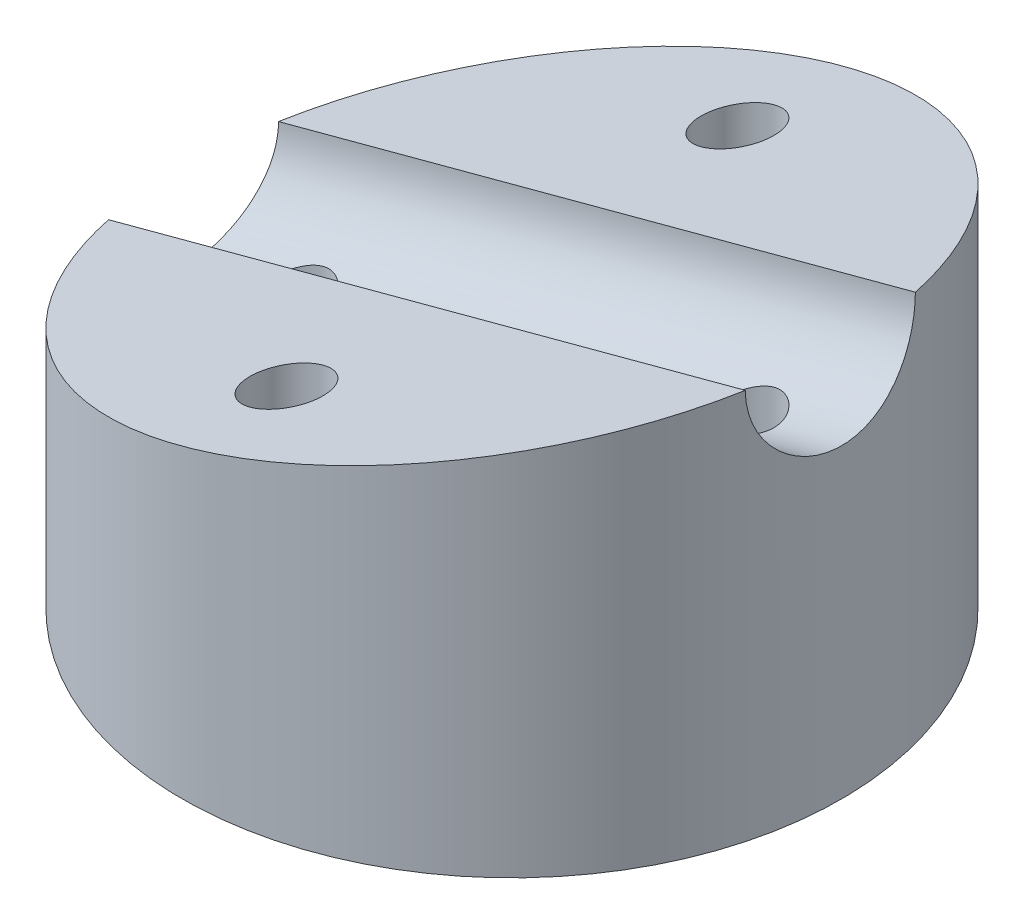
ISO-10303-21;
HEADER;
FILE_DESCRIPTION(('STEP AP214'),'2;1');
FILE_NAME('part.step','',(''),(''),'','','');
FILE_SCHEMA(('AUTOMOTIVE_DESIGN { 1 0 10303 214 1 1 1 1 }'));
ENDSEC;
DATA;
#1=APPLICATION_CONTEXT('core data for automotive mechanical design processes');
#2=APPLICATION_PROTOCOL_DEFINITION('international standard','automotive_design',2000,#1);
#3=PRODUCT_CONTEXT('',#1,'mechanical');
#4=PRODUCT('Part','Part','',(#3));
#5=PRODUCT_RELATED_PRODUCT_CATEGORY('part','',(#4));
#6=PRODUCT_DEFINITION_FORMATION('','',#4);
#7=PRODUCT_DEFINITION_CONTEXT('part definition',#1,'design');
#8=PRODUCT_DEFINITION('design','',#6,#7);
#9=PRODUCT_DEFINITION_SHAPE('','',#8);
#10=(LENGTH_UNIT() NAMED_UNIT(*) SI_UNIT(.MILLI.,.METRE.));
#11=(NAMED_UNIT(*) PLANE_ANGLE_UNIT() SI_UNIT($,.RADIAN.));
#12=(NAMED_UNIT(*) SI_UNIT($,.STERADIAN.) SOLID_ANGLE_UNIT());
#13=UNCERTAINTY_MEASURE_WITH_UNIT(LENGTH_MEASURE(1.E-05),#10,'distance_accuracy_value','');
#14=(GEOMETRIC_REPRESENTATION_CONTEXT(3) GLOBAL_UNCERTAINTY_ASSIGNED_CONTEXT((#13)) GLOBAL_UNIT_ASSIGNED_CONTEXT((#10,
#11,#12)) REPRESENTATION_CONTEXT('',''));
#15=CARTESIAN_POINT('',(0.,0.,0.));
#16=DIRECTION('',(0.,0.,1.));
#17=DIRECTION('',(1.,0.,0.));
#18=AXIS2_PLACEMENT_3D('',#15,#16,#17);
#19=CARTESIAN_POINT('',(0.,0.5,0.));
#20=DIRECTION('',(0.,-1.,0.));
#21=DIRECTION('',(0.,0.,-1.));
#22=AXIS2_PLACEMENT_3D('',#19,#20,#21);
#23=PLANE('',#22);
#24=CARTESIAN_POINT('',(0.,0.5,0.));
#25=DIRECTION('',(0.,-1.,0.));
#26=DIRECTION('',(0.,0.,-1.));
#27=AXIS2_PLACEMENT_3D('',#24,#25,#26);
#28=CIRCLE('',#27,19.);
#29=CARTESIAN_POINT('',(0.,0.5,-19.));
#30=VERTEX_POINT('',#29);
#31=EDGE_CURVE('E240',#30,#30,#28,.T.);
#32=ORIENTED_EDGE('',*,*,#31,.T.);
#33=EDGE_LOOP('',(#32));
#34=FACE_BOUND('',#33,.T.);
#35=CARTESIAN_POINT('',(0.,0.5,0.));
#36=DIRECTION('',(0.,-1.,0.));
#37=DIRECTION('',(0.,0.,-1.));
#38=AXIS2_PLACEMENT_3D('',#35,#36,#37);
#39=CIRCLE('',#38,18.5);
#40=CARTESIAN_POINT('',(0.,0.5,-18.5));
#41=VERTEX_POINT('',#40);
#42=EDGE_CURVE('E269',#41,#41,#39,.F.);
#43=ORIENTED_EDGE('',*,*,#42,.T.);
#44=EDGE_LOOP('',(#43));
#45=FACE_BOUND('',#44,.T.);
#46=ADVANCED_FACE('F197',(#34,#45),#23,.T.);
#47=CARTESIAN_POINT('',(0.,0.,-13.));
#48=DIRECTION('',(0.,-1.,0.));
#49=DIRECTION('',(0.,0.,-1.));
#50=AXIS2_PLACEMENT_3D('',#47,#48,#49);
#51=CYLINDRICAL_SURFACE('',#50,2.1);
#52=CARTESIAN_POINT('',(0.,3.8,-13.));
#53=DIRECTION('',(0.,-1.,0.));
#54=DIRECTION('',(0.,0.,-1.));
#55=AXIS2_PLACEMENT_3D('',#52,#53,#54);
#56=CIRCLE('',#55,2.1);
#57=CARTESIAN_POINT('',(0.,3.8,-15.1));
#58=VERTEX_POINT('',#57);
#59=EDGE_CURVE('E339',#58,#58,#56,.T.);
#60=ORIENTED_EDGE('',*,*,#59,.T.);
#61=EDGE_LOOP('',(#60));
#62=FACE_BOUND('',#61,.T.);
#63=CARTESIAN_POINT('',(0.,18.1173331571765,-13.));
#64=DIRECTION('',(0.258819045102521,-0.965925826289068,0.));
#65=DIRECTION('',(-0.965925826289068,-0.258819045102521,0.));
#66=AXIS2_PLACEMENT_3D('',#63,#64,#65);
#67=ELLIPSE('',#66,2.17407997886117,2.1);
#68=CARTESIAN_POINT('',(-2.1,17.5546398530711,-13.));
#69=VERTEX_POINT('',#68);
#70=EDGE_CURVE('E237',#69,#69,#67,.T.);
#71=ORIENTED_EDGE('',*,*,#70,.F.);
#72=EDGE_LOOP('',(#71));
#73=FACE_BOUND('',#72,.T.);
#74=ADVANCED_FACE('F294',(#62,#73),#51,.F.);
#75=CARTESIAN_POINT('',(0.,0.,13.));
#76=DIRECTION('',(0.,-1.,0.));
#77=DIRECTION('',(0.,0.,-1.));
#78=AXIS2_PLACEMENT_3D('',#75,#76,#77);
#79=CYLINDRICAL_SURFACE('',#78,2.1);
#80=CARTESIAN_POINT('',(0.,3.8,13.));
#81=DIRECTION('',(0.,-1.,0.));
#82=DIRECTION('',(0.,0.,-1.));
#83=AXIS2_PLACEMENT_3D('',#80,#81,#82);
#84=CIRCLE('',#83,2.1);
#85=CARTESIAN_POINT('',(0.,3.8,10.9));
#86=VERTEX_POINT('',#85);
#87=EDGE_CURVE('E206',#86,#86,#84,.T.);
#88=ORIENTED_EDGE('',*,*,#87,.T.);
#89=EDGE_LOOP('',(#88));
#90=FACE_BOUND('',#89,.T.);
#91=CARTESIAN_POINT('',(0.,18.1173331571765,13.));
#92=DIRECTION('',(0.258819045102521,-0.965925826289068,0.));
#93=DIRECTION('',(-0.965925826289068,-0.258819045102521,0.));
#94=AXIS2_PLACEMENT_3D('',#91,#92,#93);
#95=ELLIPSE('',#94,2.17407997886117,2.1);
#96=CARTESIAN_POINT('',(-2.1,17.5546398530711,13.));
#97=VERTEX_POINT('',#96);
#98=EDGE_CURVE('E315',#97,#97,#95,.T.);
#99=ORIENTED_EDGE('',*,*,#98,.F.);
#100=EDGE_LOOP('',(#99));
#101=FACE_BOUND('',#100,.T.);
#102=ADVANCED_FACE('F255',(#90,#101),#79,.F.);
#103=CARTESIAN_POINT('',(-44.4870371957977,6.19706746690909,0.));
#104=DIRECTION('',(-0.965925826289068,-0.258819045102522,0.));
#105=DIRECTION('',(0.258819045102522,-0.965925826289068,0.));
#106=AXIS2_PLACEMENT_3D('',#103,#104,#105);
#107=CYLINDRICAL_SURFACE('',#106,4.89999999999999);
#108=CARTESIAN_POINT('',(-10.9,10.1238336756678,0.));
#109=CARTESIAN_POINT('',(-10.9000058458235,10.1238378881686,-0.11720064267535));
#110=CARTESIAN_POINT('',(-10.9098522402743,10.1255909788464,-0.234536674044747));
#111=CARTESIAN_POINT('',(-10.9489782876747,10.132265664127,-0.465974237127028));
#112=CARTESIAN_POINT('',(-10.9782941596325,10.1371931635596,-0.580069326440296));
#113=CARTESIAN_POINT('',(-11.0554495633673,10.1491725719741,-0.801528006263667));
#114=CARTESIAN_POINT('',(-11.1032636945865,10.15622156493,-0.908900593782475));
#115=CARTESIAN_POINT('',(-11.2160653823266,10.1708206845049,-1.11413216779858));
#116=CARTESIAN_POINT('',(-11.2810492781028,10.1783707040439,-1.21199317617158));
#117=CARTESIAN_POINT('',(-11.4271949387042,10.1919421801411,-1.39652079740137));
#118=CARTESIAN_POINT('',(-11.5085104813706,10.1979477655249,-1.48306700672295));
#119=CARTESIAN_POINT('',(-11.6846789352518,10.2058505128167,-1.64132322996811));
#120=CARTESIAN_POINT('',(-11.779530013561,10.2077482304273,-1.71303524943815));
#121=CARTESIAN_POINT('',(-11.977843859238,10.2049696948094,-1.83811023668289));
#122=CARTESIAN_POINT('',(-12.0810872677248,10.2004289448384,-1.89182285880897));
#123=CARTESIAN_POINT('',(-12.2944069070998,10.1831138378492,-1.98128711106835));
#124=CARTESIAN_POINT('',(-12.4044793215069,10.1703440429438,-2.01704867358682));
#125=CARTESIAN_POINT('',(-12.6215207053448,10.1366077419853,-2.06845760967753));
#126=CARTESIAN_POINT('',(-12.7283331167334,10.1161245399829,-2.08509270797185));
#127=CARTESIAN_POINT('',(-12.9414238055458,10.067251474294,-2.10190377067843));
#128=CARTESIAN_POINT('',(-13.0477019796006,10.038860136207,-2.10207666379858));
#129=CARTESIAN_POINT('',(-13.2588189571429,9.97477820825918,-2.08672370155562));
#130=CARTESIAN_POINT('',(-13.3636015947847,9.93897051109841,-2.07092787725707));
#131=CARTESIAN_POINT('',(-13.5678012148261,9.8621458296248,-2.02449503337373));
#132=CARTESIAN_POINT('',(-13.6672160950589,9.82112682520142,-1.99385224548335));
#133=CARTESIAN_POINT('',(-13.8713596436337,9.73052126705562,-1.91421034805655));
#134=CARTESIAN_POINT('',(-13.9751863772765,9.68050581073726,-1.86338852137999));
#135=CARTESIAN_POINT('',(-14.1728478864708,9.57930424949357,-1.74575941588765));
#136=CARTESIAN_POINT('',(-14.2666714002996,9.5281169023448,-1.6789343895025));
#137=CARTESIAN_POINT('',(-14.4527506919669,9.42188742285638,-1.52183340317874));
#138=CARTESIAN_POINT('',(-14.5436265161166,9.36706492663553,-1.42975903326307));
#139=CARTESIAN_POINT('',(-14.7083108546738,9.26415896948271,-1.22822958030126));
#140=CARTESIAN_POINT('',(-14.7821427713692,9.21606630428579,-1.11879868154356));
#141=CARTESIAN_POINT('',(-14.8938867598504,9.1416083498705,-0.912910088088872));
#142=CARTESIAN_POINT('',(-14.9361674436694,9.11280084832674,-0.819703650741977));
#143=CARTESIAN_POINT('',(-15.0071367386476,9.06389499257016,-0.626101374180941));
#144=CARTESIAN_POINT('',(-15.0358378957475,9.04378860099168,-0.525712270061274));
#145=CARTESIAN_POINT('',(-15.0781995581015,9.01396001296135,-0.319684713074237));
#146=CARTESIAN_POINT('',(-15.0917781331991,9.00429439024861,-0.214020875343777));
#147=CARTESIAN_POINT('',(-15.1026920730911,8.99653364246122,-0.00143142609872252));
#148=CARTESIAN_POINT('',(-15.1000313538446,8.99843572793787,0.105493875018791));
#149=CARTESIAN_POINT('',(-15.0796223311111,9.01291990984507,0.307518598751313));
#150=CARTESIAN_POINT('',(-15.0632244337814,9.02454595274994,0.402829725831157));
#151=CARTESIAN_POINT('',(-15.0179953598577,9.05626530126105,0.588959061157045));
#152=CARTESIAN_POINT('',(-14.9891618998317,9.07636016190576,0.679776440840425));
#153=CARTESIAN_POINT('',(-14.9187780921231,9.12465049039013,0.85906203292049));
#154=CARTESIAN_POINT('',(-14.8767102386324,9.15317205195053,0.947236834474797));
#155=CARTESIAN_POINT('',(-14.7819303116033,9.21603983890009,1.1153705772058));
#156=CARTESIAN_POINT('',(-14.7292136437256,9.25038857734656,1.19532594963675));
#157=CARTESIAN_POINT('',(-14.605309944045,9.32890541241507,1.3583347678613));
#158=CARTESIAN_POINT('',(-14.5325169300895,9.3737650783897,1.43983322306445));
#159=CARTESIAN_POINT('',(-14.3761402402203,9.46619327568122,1.58997097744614));
#160=CARTESIAN_POINT('',(-14.2925471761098,9.51376414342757,1.65859895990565));
#161=CARTESIAN_POINT('',(-14.1019871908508,9.6166031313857,1.7919795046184));
#162=CARTESIAN_POINT('',(-13.9934117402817,9.67190544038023,1.85442603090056));
#163=CARTESIAN_POINT('',(-13.7653950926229,9.77899030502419,1.95957429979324));
#164=CARTESIAN_POINT('',(-13.6459505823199,9.83077177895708,2.00226999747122));
#165=CARTESIAN_POINT('',(-13.3975544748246,9.92744402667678,2.06603405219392));
#166=CARTESIAN_POINT('',(-13.268538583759,9.97228049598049,2.08693864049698));
#167=CARTESIAN_POINT('',(-13.0056855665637,10.0511074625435,2.10409957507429));
#168=CARTESIAN_POINT('',(-12.8718564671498,10.0851151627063,2.1003952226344));
#169=CARTESIAN_POINT('',(-12.6234022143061,10.1365282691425,2.06920660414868));
#170=CARTESIAN_POINT('',(-12.5086894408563,10.1555827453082,2.0450938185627));
#171=CARTESIAN_POINT('',(-12.2838530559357,10.1843745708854,1.97759761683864));
#172=CARTESIAN_POINT('',(-12.1737285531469,10.1941137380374,1.93421796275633));
#173=CARTESIAN_POINT('',(-11.9704047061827,10.2052383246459,1.83351895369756));
#174=CARTESIAN_POINT('',(-11.8765554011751,10.2072203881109,1.77756388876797));
#175=CARTESIAN_POINT('',(-11.6986953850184,10.2062459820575,1.65180795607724));
#176=CARTESIAN_POINT('',(-11.6146851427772,10.2032892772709,1.58200642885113));
#177=CARTESIAN_POINT('',(-11.4554864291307,10.1942242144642,1.42733304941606));
#178=CARTESIAN_POINT('',(-11.3807782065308,10.1879958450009,1.34197438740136));
#179=CARTESIAN_POINT('',(-11.2460526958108,10.1744431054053,1.16037056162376));
#180=CARTESIAN_POINT('',(-11.1860442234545,10.1671180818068,1.06411891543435));
#181=CARTESIAN_POINT('',(-11.0800021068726,10.1528972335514,0.858799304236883));
#182=CARTESIAN_POINT('',(-11.0346904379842,10.1460339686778,0.749355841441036));
#183=CARTESIAN_POINT('',(-10.9631282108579,10.134696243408,0.524435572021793));
#184=CARTESIAN_POINT('',(-10.9368419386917,10.1302173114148,0.408970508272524));
#185=CARTESIAN_POINT('',(-10.9136279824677,10.126215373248,0.24382264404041));
#186=CARTESIAN_POINT('',(-10.9085221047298,10.1253261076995,0.195209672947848));
#187=CARTESIAN_POINT('',(-10.9017068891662,10.1241343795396,0.0977389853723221));
#188=CARTESIAN_POINT('',(-10.8999975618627,10.1238319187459,0.0488812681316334));
#189=CARTESIAN_POINT('',(-10.9,10.1238336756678,0.));
#190=B_SPLINE_CURVE_WITH_KNOTS('',3,(#108,#109,#110,#111,#112,#113,#114,#115,#116,#117,#118,
#119,#120,#121,#122,#123,#124,#125,#126,#127,#128,#129,#130,#131,#132,#133,#134,#135,#136,#137,
#138,#139,#140,#141,#142,#143,#144,#145,#146,#147,#148,#149,#150,#151,#152,#153,#154,#155,#156,
#157,#158,#159,#160,#161,#162,#163,#164,#165,#166,#167,#168,#169,#170,#171,#172,#173,#174,#175,
#176,#177,#178,#179,#180,#181,#182,#183,#184,#185,#186,#187,#188,#189),.UNSPECIFIED.,.T.,.F.,(4,
2,2,2,2,2,2,2,2,2,2,2,2,2,2,2,2,2,2,2,2,2,2,2,2,2,2,2,2,2,2,2,2,2,2,2,2,2,2,2,4),(0.,
0.3514163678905,0.70348831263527,1.05507852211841,1.40659382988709,1.76158880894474,
2.11653576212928,2.46412245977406,2.8115166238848,3.14002658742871,3.46859783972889,
3.80281841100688,4.13716893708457,4.5135315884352,4.89031357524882,5.30975073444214,
5.72860851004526,6.04629081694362,6.36367904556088,6.68277855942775,7.00180112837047,
7.2927067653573,7.58366584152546,7.88782263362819,8.19211093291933,8.54513708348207,
8.89847220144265,9.30736404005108,9.71638094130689,10.1284500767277,10.5398612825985,
10.8941775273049,11.2484246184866,11.574817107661,11.901225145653,12.2405413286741,
12.5800605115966,12.9343579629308,13.2879886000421,13.4345545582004,13.5811209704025),.UNSPECIFIED.);
#191=CARTESIAN_POINT('',(-10.9,10.1238336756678,0.));
#192=VERTEX_POINT('',#191);
#193=EDGE_CURVE('E270',#192,#192,#190,.T.);
#194=ORIENTED_EDGE('',*,*,#193,.F.);
#195=EDGE_LOOP('',(#194));
#196=FACE_BOUND('',#195,.T.);
#197=CARTESIAN_POINT('',(13.,17.0173096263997,-2.09999999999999));
#198=CARTESIAN_POINT('',(12.8775165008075,16.9844837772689,-2.09999522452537));
#199=CARTESIAN_POINT('',(12.7561719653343,16.9466387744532,-2.08922928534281));
#200=CARTESIAN_POINT('',(12.5194654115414,16.8632645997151,-2.04783480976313));
#201=CARTESIAN_POINT('',(12.40412459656,16.817710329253,-2.01714043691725));
#202=CARTESIAN_POINT('',(12.1826871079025,16.7222274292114,-1.93797012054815));
#203=CARTESIAN_POINT('',(12.0765351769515,16.6723291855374,-1.88961115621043));
#204=CARTESIAN_POINT('',(11.8742401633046,16.5709065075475,-1.77654190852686));
#205=CARTESIAN_POINT('',(11.7780971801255,16.5193820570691,-1.71183146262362));
#206=CARTESIAN_POINT('',(11.5880787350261,16.4125577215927,-1.55972918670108));
#207=CARTESIAN_POINT('',(11.4954195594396,16.3574041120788,-1.4707037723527));
#208=CARTESIAN_POINT('',(11.3265428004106,16.2530902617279,-1.27521626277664));
#209=CARTESIAN_POINT('',(11.2503084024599,16.2039239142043,-1.16877219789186));
#210=CARTESIAN_POINT('',(11.1327354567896,16.126225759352,-0.966299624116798));
#211=CARTESIAN_POINT('',(11.0874036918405,16.0955444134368,-0.873414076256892));
#212=CARTESIAN_POINT('',(11.0103773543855,16.0427471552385,-0.679868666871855));
#213=CARTESIAN_POINT('',(10.9786703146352,16.0206234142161,-0.579216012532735));
#214=CARTESIAN_POINT('',(10.930449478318,15.9867667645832,-0.371940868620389));
#215=CARTESIAN_POINT('',(10.9140269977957,15.9750963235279,-0.26528648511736));
#216=CARTESIAN_POINT('',(10.8978303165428,15.9635878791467,-0.0500876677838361));
#217=CARTESIAN_POINT('',(10.8980500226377,15.9637455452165,0.058456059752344));
#218=CARTESIAN_POINT('',(10.9142531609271,15.9752556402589,0.262951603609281));
#219=CARTESIAN_POINT('',(10.928690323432,15.9855099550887,0.359095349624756));
#220=CARTESIAN_POINT('',(10.9702570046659,16.0147329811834,0.547197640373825));
#221=CARTESIAN_POINT('',(10.9973885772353,16.0337031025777,0.639155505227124));
#222=CARTESIAN_POINT('',(11.0641804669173,16.0797080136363,0.819875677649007));
#223=CARTESIAN_POINT('',(11.1042266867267,16.1069895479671,0.908430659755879));
#224=CARTESIAN_POINT('',(11.1950126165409,16.1675600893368,1.07761321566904));
#225=CARTESIAN_POINT('',(11.245756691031,16.200851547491,1.15823753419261));
#226=CARTESIAN_POINT('',(11.3651725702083,16.2771394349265,1.32257153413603));
#227=CARTESIAN_POINT('',(11.4354044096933,16.3208402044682,1.40481881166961));
#228=CARTESIAN_POINT('',(11.5866099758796,16.4112591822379,1.55687018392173));
#229=CARTESIAN_POINT('',(11.6675926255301,16.4579798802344,1.62666382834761));
#230=CARTESIAN_POINT('',(11.8529275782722,16.5596479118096,1.76339205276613));
#231=CARTESIAN_POINT('',(11.9589388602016,16.6146980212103,1.82801782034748));
#232=CARTESIAN_POINT('',(12.1819381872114,16.7218880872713,1.93810244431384));
#233=CARTESIAN_POINT('',(12.2989313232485,16.7740266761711,1.98355235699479));
#234=CARTESIAN_POINT('',(12.5444851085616,16.8728152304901,2.05406099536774));
#235=CARTESIAN_POINT('',(12.6732448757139,16.9193176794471,2.07864471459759));
#236=CARTESIAN_POINT('',(12.9363289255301,17.0017801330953,2.1031691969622));
#237=CARTESIAN_POINT('',(13.0706440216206,17.0377568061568,2.10314913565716));
#238=CARTESIAN_POINT('',(13.3214170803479,17.0929512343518,2.07855068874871));
#239=CARTESIAN_POINT('',(13.4378493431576,17.1137713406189,2.05727265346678));
#240=CARTESIAN_POINT('',(13.6666591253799,17.1457561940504,1.99489479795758));
#241=CARTESIAN_POINT('',(13.7790378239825,17.1569237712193,1.95380079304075));
#242=CARTESIAN_POINT('',(13.985913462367,17.1702812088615,1.85737422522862));
#243=CARTESIAN_POINT('',(14.0811123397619,17.1731795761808,1.80362808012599));
#244=CARTESIAN_POINT('',(14.2620229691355,17.1737427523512,1.68201632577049));
#245=CARTESIAN_POINT('',(14.3477336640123,17.1714069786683,1.61414914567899));
#246=CARTESIAN_POINT('',(14.5102605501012,17.1633197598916,1.46349334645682));
#247=CARTESIAN_POINT('',(14.5866687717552,17.1574534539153,1.38027134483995));
#248=CARTESIAN_POINT('',(14.7251411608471,17.1443368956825,1.20273368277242));
#249=CARTESIAN_POINT('',(14.7872022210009,17.137086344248,1.10841562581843));
#250=CARTESIAN_POINT('',(14.8979258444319,17.1227364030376,0.906493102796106));
#251=CARTESIAN_POINT('',(14.9458446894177,17.115659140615,0.798477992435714));
#252=CARTESIAN_POINT('',(15.022940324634,17.1036716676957,0.57583838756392));
#253=CARTESIAN_POINT('',(15.0521175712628,17.0987614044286,0.461214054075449));
#254=CARTESIAN_POINT('',(15.0908199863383,17.0921513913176,0.228763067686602));
#255=CARTESIAN_POINT('',(15.1003729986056,17.0904470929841,0.110941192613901));
#256=CARTESIAN_POINT('',(15.0996046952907,17.0905821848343,-0.124629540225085));
#257=CARTESIAN_POINT('',(15.0892845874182,17.0924213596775,-0.242378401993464));
#258=CARTESIAN_POINT('',(15.0493384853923,17.0992275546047,-0.473024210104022));
#259=CARTESIAN_POINT('',(15.0199402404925,17.1041576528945,-0.585961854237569));
#260=CARTESIAN_POINT('',(14.942924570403,17.1160921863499,-0.805333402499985));
#261=CARTESIAN_POINT('',(14.8953047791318,17.1230968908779,-0.911766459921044));
#262=CARTESIAN_POINT('',(14.7825284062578,17.1376703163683,-1.11642109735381));
#263=CARTESIAN_POINT('',(14.7171814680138,17.145244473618,-1.21453741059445));
#264=CARTESIAN_POINT('',(14.5709410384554,17.1587629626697,-1.39855470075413));
#265=CARTESIAN_POINT('',(14.4900470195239,17.1647072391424,-1.48445526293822));
#266=CARTESIAN_POINT('',(14.314625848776,17.1725447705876,-1.6418540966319));
#267=CARTESIAN_POINT('',(14.220057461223,17.1744254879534,-1.71330717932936));
#268=CARTESIAN_POINT('',(14.0202838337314,17.1716184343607,-1.83927932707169));
#269=CARTESIAN_POINT('',(13.9150796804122,17.1669313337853,-1.89380011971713));
#270=CARTESIAN_POINT('',(13.7026019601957,17.1494146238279,-1.98216861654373));
#271=CARTESIAN_POINT('',(13.5956400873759,17.1369650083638,-2.01684371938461));
#272=CARTESIAN_POINT('',(13.3789952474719,17.1034410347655,-2.06850646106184));
#273=CARTESIAN_POINT('',(13.2693184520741,17.0823848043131,-2.08553101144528));
#274=CARTESIAN_POINT('',(13.1333583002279,17.0510489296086,-2.09593448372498));
#275=CARTESIAN_POINT('',(13.1066240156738,17.0446336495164,-2.09746162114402));
#276=CARTESIAN_POINT('',(13.0532419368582,17.0313275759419,-2.09949476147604));
#277=CARTESIAN_POINT('',(13.0265941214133,17.0244369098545,-2.10000103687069));
#278=CARTESIAN_POINT('',(13.,17.0173096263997,-2.09999999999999));
#279=B_SPLINE_CURVE_WITH_KNOTS('',3,(#197,#198,#199,#200,#201,#202,#203,#204,#205,#206,#207,
#208,#209,#210,#211,#212,#213,#214,#215,#216,#217,#218,#219,#220,#221,#222,#223,#224,#225,#226,
#227,#228,#229,#230,#231,#232,#233,#234,#235,#236,#237,#238,#239,#240,#241,#242,#243,#244,#245,
#246,#247,#248,#249,#250,#251,#252,#253,#254,#255,#256,#257,#258,#259,#260,#261,#262,#263,#264,
#265,#266,#267,#268,#269,#270,#271,#272,#273,#274,#275,#276,#277,#278),.UNSPECIFIED.,.T.,.F.,(4,
2,2,2,2,2,2,2,2,2,2,2,2,2,2,2,2,2,2,2,2,2,2,2,2,2,2,2,2,2,2,2,2,2,2,2,2,2,2,2,4),(0.,
0.380302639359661,0.761868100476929,1.14095124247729,1.52003815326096,1.93752651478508,
2.35458542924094,2.67672665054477,2.99857246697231,3.32232900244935,3.64596700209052,
3.93790251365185,4.2298852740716,4.53155788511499,4.83335381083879,5.18197816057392,
5.53089369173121,5.93652474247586,6.34234477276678,6.75717260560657,7.17133992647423,
7.52985413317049,7.88826319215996,8.2148789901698,8.54153114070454,8.87943275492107,
9.2174074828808,9.57085942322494,9.92430275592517,10.2772442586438,10.6301643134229,
10.9789469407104,11.3277748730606,11.680507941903,12.0332529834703,12.3870848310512,
12.7408805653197,13.0785865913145,13.4155849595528,13.4981798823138,13.5807527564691),.UNSPECIFIED.);
#280=CARTESIAN_POINT('',(13.,17.0173096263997,-2.09999999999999));
#281=VERTEX_POINT('',#280);
#282=EDGE_CURVE('E263',#281,#281,#279,.T.);
#283=ORIENTED_EDGE('',*,*,#282,.F.);
#284=EDGE_LOOP('',(#283));
#285=FACE_BOUND('',#284,.T.);
#286=DIRECTION('',(-0.965925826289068,-0.258819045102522,0.));
#287=VECTOR('',#286,1.);
#288=CARTESIAN_POINT('',(-44.4870371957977,6.1970674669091,4.89999999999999));
#289=LINE('',#288,#287);
#290=CARTESIAN_POINT('',(18.3572873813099,23.0361534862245,4.89999999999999));
#291=VERTEX_POINT('',#290);
#292=CARTESIAN_POINT('',(-18.3572873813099,13.1985128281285,4.90000000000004));
#293=VERTEX_POINT('',#292);
#294=EDGE_CURVE('E212',#291,#293,#289,.T.);
#295=ORIENTED_EDGE('',*,*,#294,.F.);
#296=CARTESIAN_POINT('',(19.,28.2812210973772,0.));
#297=CARTESIAN_POINT('',(19.0000022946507,28.281226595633,-0.127107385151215));
#298=CARTESIAN_POINT('',(18.998722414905,28.2757561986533,-0.254172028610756));
#299=CARTESIAN_POINT('',(18.9936462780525,28.2539632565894,-0.507353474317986));
#300=CARTESIAN_POINT('',(18.9898496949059,28.2376393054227,-0.633470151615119));
#301=CARTESIAN_POINT('',(18.979846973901,28.1943463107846,-0.883808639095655));
#302=CARTESIAN_POINT('',(18.9736398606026,28.1673729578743,-1.00802966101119));
#303=CARTESIAN_POINT('',(18.9589928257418,28.1031259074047,-1.25369036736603));
#304=CARTESIAN_POINT('',(18.9505520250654,28.0658481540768,-1.37512893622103));
#305=CARTESIAN_POINT('',(18.9317076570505,27.9816110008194,-1.61391800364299));
#306=CARTESIAN_POINT('',(18.9213117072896,27.9346891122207,-1.73128234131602));
#307=CARTESIAN_POINT('',(18.8988109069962,27.8316061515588,-1.96172801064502));
#308=CARTESIAN_POINT('',(18.8867054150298,27.7754416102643,-2.07480771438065));
#309=CARTESIAN_POINT('',(18.8482812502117,27.5939566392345,-2.40660194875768));
#310=CARTESIAN_POINT('',(18.819837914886,27.4555715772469,-2.61807631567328));
#311=CARTESIAN_POINT('',(18.7581906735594,27.1398963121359,-3.02921741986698));
#312=CARTESIAN_POINT('',(18.7248048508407,26.9607915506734,-3.22744994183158));
#313=CARTESIAN_POINT('',(18.6578440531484,26.57451836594,-3.59439445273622));
#314=CARTESIAN_POINT('',(18.6242690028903,26.3673378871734,-3.76309368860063));
#315=CARTESIAN_POINT('',(18.5565890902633,25.9069586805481,-4.08445846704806));
#316=CARTESIAN_POINT('',(18.5228036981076,25.6512104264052,-4.23354166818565));
#317=CARTESIAN_POINT('',(18.4625179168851,25.1182130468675,-4.48918641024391));
#318=CARTESIAN_POINT('',(18.4360201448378,24.8409562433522,-4.59573268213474));
#319=CARTESIAN_POINT('',(18.4037375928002,24.4091514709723,-4.72275001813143));
#320=CARTESIAN_POINT('',(18.3941172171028,24.2596303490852,-4.75998358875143));
#321=CARTESIAN_POINT('',(18.3780443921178,23.9578262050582,-4.82167235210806));
#322=CARTESIAN_POINT('',(18.3715906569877,23.805544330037,-4.84613273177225));
#323=CARTESIAN_POINT('',(18.3621220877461,23.4993161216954,-4.88188597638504));
#324=CARTESIAN_POINT('',(18.359107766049,23.3453695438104,-4.89317687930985));
#325=CARTESIAN_POINT('',(18.3566868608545,23.0371131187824,-4.90225189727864));
#326=CARTESIAN_POINT('',(18.3572785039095,22.8828034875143,-4.90004265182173));
#327=CARTESIAN_POINT('',(18.3619978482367,22.5824064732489,-4.88232642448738));
#328=CARTESIAN_POINT('',(18.3659552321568,22.4362785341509,-4.86745990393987));
#329=CARTESIAN_POINT('',(18.3771073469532,22.146032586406,-4.82518433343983));
#330=CARTESIAN_POINT('',(18.3843006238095,22.001913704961,-4.79778091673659));
#331=CARTESIAN_POINT('',(18.4017379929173,21.7168305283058,-4.73045936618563));
#332=CARTESIAN_POINT('',(18.4119817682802,21.5758659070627,-4.69054253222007));
#333=CARTESIAN_POINT('',(18.4352215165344,21.2982708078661,-4.59835460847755));
#334=CARTESIAN_POINT('',(18.448217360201,21.1616401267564,-4.54608409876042));
#335=CARTESIAN_POINT('',(18.4756663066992,20.9022861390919,-4.4331602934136));
#336=CARTESIAN_POINT('',(18.4899767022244,20.7792282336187,-4.37323928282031));
#337=CARTESIAN_POINT('',(18.5202608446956,20.5388050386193,-4.24315884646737));
#338=CARTESIAN_POINT('',(18.5362351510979,20.4214416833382,-4.17299597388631));
#339=CARTESIAN_POINT('',(18.5693775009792,20.1933588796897,-4.02294873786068));
#340=CARTESIAN_POINT('',(18.5865450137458,20.0826365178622,-3.94306868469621));
#341=CARTESIAN_POINT('',(18.6215923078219,19.8685192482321,-3.77408863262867));
#342=CARTESIAN_POINT('',(18.6394723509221,19.765127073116,-3.68498522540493));
#343=CARTESIAN_POINT('',(18.6751010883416,19.5682085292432,-3.49990253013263));
#344=CARTESIAN_POINT('',(18.6928463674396,19.4745382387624,-3.40407560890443));
#345=CARTESIAN_POINT('',(18.7280399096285,19.2955488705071,-3.20480252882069));
#346=CARTESIAN_POINT('',(18.7454880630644,19.2102328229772,-3.10135362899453));
#347=CARTESIAN_POINT('',(18.7795985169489,19.0485411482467,-2.88762601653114));
#348=CARTESIAN_POINT('',(18.7962610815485,18.9721625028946,-2.77734962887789));
#349=CARTESIAN_POINT('',(18.8283626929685,18.8287384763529,-2.55065992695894));
#350=CARTESIAN_POINT('',(18.8438012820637,18.7616965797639,-2.43424434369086));
#351=CARTESIAN_POINT('',(18.8731891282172,18.6367116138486,-2.19486312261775));
#352=CARTESIAN_POINT('',(18.8871209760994,18.578871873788,-2.07184138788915));
#353=CARTESIAN_POINT('',(18.9129338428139,18.4734688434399,-1.82121084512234));
#354=CARTESIAN_POINT('',(18.9248141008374,18.4259093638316,-1.69360035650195));
#355=CARTESIAN_POINT('',(18.9461944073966,18.3413791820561,-1.43477215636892));
#356=CARTESIAN_POINT('',(18.9556952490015,18.3044049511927,-1.30355566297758));
#357=CARTESIAN_POINT('',(18.9720715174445,18.2412204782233,-1.03834700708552));
#358=CARTESIAN_POINT('',(18.9789459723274,18.2150142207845,-0.904353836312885));
#359=CARTESIAN_POINT('',(18.9899205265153,18.173380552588,-0.633559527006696));
#360=CARTESIAN_POINT('',(18.9939996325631,18.1580346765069,-0.496744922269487));
#361=CARTESIAN_POINT('',(18.9991977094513,18.1385141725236,-0.22225144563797));
#362=CARTESIAN_POINT('',(19.0003155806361,18.1343436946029,-0.0845722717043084));
#363=CARTESIAN_POINT('',(18.9991469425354,18.1386875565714,0.328196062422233));
#364=CARTESIAN_POINT('',(18.9923500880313,18.1640128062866,0.603306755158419));
#365=CARTESIAN_POINT('',(18.9673950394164,18.2590474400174,1.14533565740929));
#366=CARTESIAN_POINT('',(18.9492262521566,18.3287982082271,1.41224598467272));
#367=CARTESIAN_POINT('',(18.9034875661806,18.5111147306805,1.93021666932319));
#368=CARTESIAN_POINT('',(18.8759174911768,18.6236812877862,2.1812767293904));
#369=CARTESIAN_POINT('',(18.8144112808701,18.8888882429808,2.66011944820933));
#370=CARTESIAN_POINT('',(18.7804805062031,19.0414949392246,2.8879214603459));
#371=CARTESIAN_POINT('',(18.7100125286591,19.3830891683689,3.31392762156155));
#372=CARTESIAN_POINT('',(18.673475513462,19.5720740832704,3.51213389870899));
#373=CARTESIAN_POINT('',(18.6022255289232,19.9798484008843,3.87177511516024));
#374=CARTESIAN_POINT('',(18.5675003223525,20.1983877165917,4.03349108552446));
#375=CARTESIAN_POINT('',(18.5034886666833,20.6603381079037,4.31766304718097));
#376=CARTESIAN_POINT('',(18.4742014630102,20.9037457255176,4.44012448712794));
#377=CARTESIAN_POINT('',(18.4245818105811,21.4055982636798,4.64171413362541));
#378=CARTESIAN_POINT('',(18.4041553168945,21.6638505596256,4.72129972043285));
#379=CARTESIAN_POINT('',(18.3738412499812,22.1903487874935,4.83793500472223));
#380=CARTESIAN_POINT('',(18.3639544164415,22.4585954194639,4.87498171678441));
#381=CARTESIAN_POINT('',(18.3553914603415,23.0021791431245,4.90712636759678));
#382=CARTESIAN_POINT('',(18.3569040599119,23.2775600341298,4.90151812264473));
#383=CARTESIAN_POINT('',(18.3710330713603,23.8239124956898,4.84828362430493));
#384=CARTESIAN_POINT('',(18.3836525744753,24.094882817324,4.80064567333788));
#385=CARTESIAN_POINT('',(18.4194099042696,24.6417233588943,4.66162713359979));
#386=CARTESIAN_POINT('',(18.4431229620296,24.9169436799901,4.56783755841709));
#387=CARTESIAN_POINT('',(18.4983713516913,25.4486611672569,4.33867679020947));
#388=CARTESIAN_POINT('',(18.5299099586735,25.705150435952,4.20328818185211));
#389=CARTESIAN_POINT('',(18.5993204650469,26.2069905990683,3.88499451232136));
#390=CARTESIAN_POINT('',(18.6374491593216,26.4508985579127,3.69984111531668));
#391=CARTESIAN_POINT('',(18.6949124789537,26.7898472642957,3.39280190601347));
#392=CARTESIAN_POINT('',(18.7141256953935,26.898412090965,3.2854840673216));
#393=CARTESIAN_POINT('',(18.7520545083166,27.1055950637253,3.06158934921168));
#394=CARTESIAN_POINT('',(18.7707703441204,27.2042180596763,2.9450170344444));
#395=CARTESIAN_POINT('',(18.8067187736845,27.3884807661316,2.70585180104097));
#396=CARTESIAN_POINT('',(18.8239746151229,27.4743541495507,2.58344236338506));
#397=CARTESIAN_POINT('',(18.8568785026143,27.6345610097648,2.33115917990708));
#398=CARTESIAN_POINT('',(18.8725273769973,27.7089004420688,2.20128933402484));
#399=CARTESIAN_POINT('',(18.901675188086,27.8450133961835,1.93508838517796));
#400=CARTESIAN_POINT('',(18.9151768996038,27.9068031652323,1.79876592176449));
#401=CARTESIAN_POINT('',(18.9395650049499,28.0169916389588,1.52064898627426));
#402=CARTESIAN_POINT('',(18.9504522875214,28.0653948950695,1.37885639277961));
#403=CARTESIAN_POINT('',(18.9728613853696,28.164169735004,1.03472903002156));
#404=CARTESIAN_POINT('',(18.9829728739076,28.2079384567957,0.83036118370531));
#405=CARTESIAN_POINT('',(18.9965395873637,28.2664565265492,0.417289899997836));
#406=CARTESIAN_POINT('',(18.9999962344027,28.2812120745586,0.208587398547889));
#407=CARTESIAN_POINT('',(19.,28.2812210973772,0.));
#408=B_SPLINE_CURVE_WITH_KNOTS('',3,(#296,#297,#298,#299,#300,#301,#302,#303,#304,#305,#306,
#307,#308,#309,#310,#311,#312,#313,#314,#315,#316,#317,#318,#319,#320,#321,#322,#323,#324,#325,
#326,#327,#328,#329,#330,#331,#332,#333,#334,#335,#336,#337,#338,#339,#340,#341,#342,#343,#344,
#345,#346,#347,#348,#349,#350,#351,#352,#353,#354,#355,#356,#357,#358,#359,#360,#361,#362,#363,
#364,#365,#366,#367,#368,#369,#370,#371,#372,#373,#374,#375,#376,#377,#378,#379,#380,#381,#382,
#383,#384,#385,#386,#387,#388,#389,#390,#391,#392,#393,#394,#395,#396,#397,#398,#399,#400,#401,
#402,#403,#404,#405,#406,#407),.UNSPECIFIED.,.T.,.F.,(4,2,2,2,2,2,2,2,2,2,2,2,2,2,2,2,2,2,2,2,2,
2,2,2,2,2,2,2,2,2,2,2,2,2,2,2,2,2,2,2,2,2,2,2,2,2,2,2,2,2,2,2,2,2,2,4),(0.,0.381124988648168,
0.76229936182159,1.14362814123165,1.52510722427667,1.90512968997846,2.28529512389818,
3.04497924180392,3.84951412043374,4.65439556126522,5.54439639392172,6.43471641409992,
6.89739057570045,7.35987670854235,7.82243173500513,8.28475929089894,8.72499505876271,
9.16503320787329,9.60502566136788,10.0449974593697,10.4573478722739,10.8698373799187,
11.2821445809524,11.6946046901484,12.0996515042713,12.5048446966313,12.9099006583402,
13.3151073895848,13.7245842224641,14.1342125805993,14.5437042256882,14.9533472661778,
15.3660339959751,15.7788739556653,16.6036819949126,17.4292595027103,18.25485249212,
19.0797527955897,19.904593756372,20.722847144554,21.540986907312,22.3502170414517,
23.1595039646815,23.9822180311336,24.8051611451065,25.6765283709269,26.5482608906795,
27.4691340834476,27.930225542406,28.3910909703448,28.842041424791,29.2927582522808,
29.7428877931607,30.1928641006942,30.8184364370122,31.4438750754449),.UNSPECIFIED.);
#409=CARTESIAN_POINT('',(18.3572873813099,23.0361534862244,-4.90000000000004));
#410=VERTEX_POINT('',#409);
#411=EDGE_CURVE('E231',#410,#291,#408,.T.);
#412=ORIENTED_EDGE('',*,*,#411,.F.);
#413=DIRECTION('',(-0.965925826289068,-0.258819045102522,0.));
#414=VECTOR('',#413,1.);
#415=CARTESIAN_POINT('',(-44.4870371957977,6.1970674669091,-4.89999999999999));
#416=LINE('',#415,#414);
#417=CARTESIAN_POINT('',(-18.3572873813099,13.1985128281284,-4.89999999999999));
#418=VERTEX_POINT('',#417);
#419=EDGE_CURVE('E219',#418,#410,#416,.F.);
#420=ORIENTED_EDGE('',*,*,#419,.F.);
#421=CARTESIAN_POINT('',(-19.,7.95344521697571,0.));
#422=CARTESIAN_POINT('',(-19.0000022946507,7.95343971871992,-0.127107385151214));
#423=CARTESIAN_POINT('',(-18.998722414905,7.95891011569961,-0.254172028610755));
#424=CARTESIAN_POINT('',(-18.9936462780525,7.9807030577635,-0.507353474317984));
#425=CARTESIAN_POINT('',(-18.9898496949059,7.9970270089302,-0.633470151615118));
#426=CARTESIAN_POINT('',(-18.979846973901,8.04032000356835,-0.883808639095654));
#427=CARTESIAN_POINT('',(-18.9736398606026,8.0672933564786,-1.00802966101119));
#428=CARTESIAN_POINT('',(-18.9589928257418,8.13154040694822,-1.25369036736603));
#429=CARTESIAN_POINT('',(-18.9505520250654,8.1688181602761,-1.37512893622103));
#430=CARTESIAN_POINT('',(-18.9317076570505,8.25305531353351,-1.61391800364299));
#431=CARTESIAN_POINT('',(-18.9213117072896,8.29997720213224,-1.73128234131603));
#432=CARTESIAN_POINT('',(-18.8988109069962,8.40306016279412,-1.96172801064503));
#433=CARTESIAN_POINT('',(-18.8867054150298,8.45922470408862,-2.07480771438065));
#434=CARTESIAN_POINT('',(-18.8482812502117,8.64070967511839,-2.40660194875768));
#435=CARTESIAN_POINT('',(-18.819837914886,8.77909473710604,-2.61807631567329));
#436=CARTESIAN_POINT('',(-18.7581906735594,9.09477000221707,-3.02921741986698));
#437=CARTESIAN_POINT('',(-18.7248048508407,9.27387476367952,-3.22744994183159));
#438=CARTESIAN_POINT('',(-18.6578440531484,9.66014794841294,-3.59439445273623));
#439=CARTESIAN_POINT('',(-18.6242690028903,9.86732842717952,-3.76309368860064));
#440=CARTESIAN_POINT('',(-18.5565890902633,10.3277076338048,-4.08445846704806));
#441=CARTESIAN_POINT('',(-18.5228036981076,10.5834558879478,-4.23354166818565));
#442=CARTESIAN_POINT('',(-18.4625179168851,11.1164532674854,-4.48918641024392));
#443=CARTESIAN_POINT('',(-18.4360201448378,11.3937100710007,-4.59573268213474));
#444=CARTESIAN_POINT('',(-18.4037375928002,11.8255148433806,-4.72275001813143));
#445=CARTESIAN_POINT('',(-18.3941172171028,11.9750359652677,-4.75998358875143));
#446=CARTESIAN_POINT('',(-18.3780443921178,12.2768401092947,-4.82167235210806));
#447=CARTESIAN_POINT('',(-18.3715906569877,12.4291219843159,-4.84613273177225));
#448=CARTESIAN_POINT('',(-18.3621220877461,12.7353501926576,-4.88188597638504));
#449=CARTESIAN_POINT('',(-18.359107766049,12.8892967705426,-4.89317687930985));
#450=CARTESIAN_POINT('',(-18.3566868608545,13.1975531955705,-4.90225189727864));
#451=CARTESIAN_POINT('',(-18.3572785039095,13.3518628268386,-4.90004265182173));
#452=CARTESIAN_POINT('',(-18.3619978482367,13.652259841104,-4.88232642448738));
#453=CARTESIAN_POINT('',(-18.3659552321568,13.798387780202,-4.86745990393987));
#454=CARTESIAN_POINT('',(-18.3771073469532,14.0886337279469,-4.82518433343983));
#455=CARTESIAN_POINT('',(-18.3843006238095,14.2327526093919,-4.79778091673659));
#456=CARTESIAN_POINT('',(-18.4017379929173,14.5178357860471,-4.73045936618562));
#457=CARTESIAN_POINT('',(-18.4119817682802,14.6588004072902,-4.69054253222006));
#458=CARTESIAN_POINT('',(-18.4352215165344,14.9363955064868,-4.59835460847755));
#459=CARTESIAN_POINT('',(-18.448217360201,15.0730261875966,-4.54608409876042));
#460=CARTESIAN_POINT('',(-18.4756663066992,15.332380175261,-4.4331602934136));
#461=CARTESIAN_POINT('',(-18.4899767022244,15.4554380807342,-4.37323928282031));
#462=CARTESIAN_POINT('',(-18.5202608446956,15.6958612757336,-4.24315884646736));
#463=CARTESIAN_POINT('',(-18.5362351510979,15.8132246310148,-4.17299597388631));
#464=CARTESIAN_POINT('',(-18.5693775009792,16.0413074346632,-4.02294873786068));
#465=CARTESIAN_POINT('',(-18.5865450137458,16.1520297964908,-3.94306868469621));
#466=CARTESIAN_POINT('',(-18.6215923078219,16.3661470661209,-3.77408863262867));
#467=CARTESIAN_POINT('',(-18.6394723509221,16.4695392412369,-3.68498522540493));
#468=CARTESIAN_POINT('',(-18.6751010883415,16.6664577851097,-3.49990253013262));
#469=CARTESIAN_POINT('',(-18.6928463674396,16.7601280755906,-3.40407560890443));
#470=CARTESIAN_POINT('',(-18.7280399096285,16.9391174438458,-3.20480252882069));
#471=CARTESIAN_POINT('',(-18.7454880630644,17.0244334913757,-3.10135362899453));
#472=CARTESIAN_POINT('',(-18.7795985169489,17.1861251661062,-2.88762601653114));
#473=CARTESIAN_POINT('',(-18.7962610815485,17.2625038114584,-2.77734962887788));
#474=CARTESIAN_POINT('',(-18.8283626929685,17.405927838,-2.55065992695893));
#475=CARTESIAN_POINT('',(-18.8438012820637,17.472969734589,-2.43424434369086));
#476=CARTESIAN_POINT('',(-18.8731891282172,17.5979547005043,-2.19486312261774));
#477=CARTESIAN_POINT('',(-18.8871209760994,17.655794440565,-2.07184138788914));
#478=CARTESIAN_POINT('',(-18.9129338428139,17.761197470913,-1.82121084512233));
#479=CARTESIAN_POINT('',(-18.9248141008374,17.8087569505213,-1.69360035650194));
#480=CARTESIAN_POINT('',(-18.9461944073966,17.8932871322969,-1.43477215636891));
#481=CARTESIAN_POINT('',(-18.9556952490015,17.9302613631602,-1.30355566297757));
#482=CARTESIAN_POINT('',(-18.9720715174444,17.9934458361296,-1.03834700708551));
#483=CARTESIAN_POINT('',(-18.9789459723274,18.0196520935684,-0.904353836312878));
#484=CARTESIAN_POINT('',(-18.9899205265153,18.0612857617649,-0.63355952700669));
#485=CARTESIAN_POINT('',(-18.9939996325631,18.0766316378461,-0.496744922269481));
#486=CARTESIAN_POINT('',(-18.9991977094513,18.0961521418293,-0.222251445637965));
#487=CARTESIAN_POINT('',(-19.0003155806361,18.10032261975,-0.0845722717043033));
#488=CARTESIAN_POINT('',(-18.9991469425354,18.0959787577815,0.328196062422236));
#489=CARTESIAN_POINT('',(-18.9923500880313,18.0706535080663,0.603306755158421));
#490=CARTESIAN_POINT('',(-18.9673950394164,17.9756188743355,1.14533565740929));
#491=CARTESIAN_POINT('',(-18.9492262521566,17.9058681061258,1.41224598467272));
#492=CARTESIAN_POINT('',(-18.9034875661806,17.7235515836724,1.93021666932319));
#493=CARTESIAN_POINT('',(-18.8759174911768,17.6109850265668,2.1812767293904));
#494=CARTESIAN_POINT('',(-18.81441128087,17.3457780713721,2.66011944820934));
#495=CARTESIAN_POINT('',(-18.7804805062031,17.1931713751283,2.8879214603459));
#496=CARTESIAN_POINT('',(-18.7100125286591,16.851577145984,3.31392762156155));
#497=CARTESIAN_POINT('',(-18.673475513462,16.6625922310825,3.512133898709));
#498=CARTESIAN_POINT('',(-18.6022255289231,16.2548179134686,3.87177511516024));
#499=CARTESIAN_POINT('',(-18.5675003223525,16.0362785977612,4.03349108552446));
#500=CARTESIAN_POINT('',(-18.5034886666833,15.5743282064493,4.31766304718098));
#501=CARTESIAN_POINT('',(-18.4742014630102,15.3309205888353,4.44012448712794));
#502=CARTESIAN_POINT('',(-18.424581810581,14.8290680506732,4.64171413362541));
#503=CARTESIAN_POINT('',(-18.4041553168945,14.5708157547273,4.72129972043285));
#504=CARTESIAN_POINT('',(-18.3738412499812,14.0443175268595,4.83793500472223));
#505=CARTESIAN_POINT('',(-18.3639544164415,13.776070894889,4.87498171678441));
#506=CARTESIAN_POINT('',(-18.3553914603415,13.2324871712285,4.90712636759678));
#507=CARTESIAN_POINT('',(-18.3569040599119,12.9571062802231,4.90151812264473));
#508=CARTESIAN_POINT('',(-18.3710330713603,12.4107538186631,4.84828362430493));
#509=CARTESIAN_POINT('',(-18.3836525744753,12.1397834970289,4.80064567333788));
#510=CARTESIAN_POINT('',(-18.4194099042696,11.5929429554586,4.6616271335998));
#511=CARTESIAN_POINT('',(-18.4431229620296,11.3177226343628,4.56783755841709));
#512=CARTESIAN_POINT('',(-18.4983713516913,10.7860051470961,4.33867679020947));
#513=CARTESIAN_POINT('',(-18.5299099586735,10.5295158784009,4.20328818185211));
#514=CARTESIAN_POINT('',(-18.5993204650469,10.0276757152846,3.88499451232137));
#515=CARTESIAN_POINT('',(-18.6374491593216,9.78376775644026,3.69984111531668));
#516=CARTESIAN_POINT('',(-18.6949124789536,9.44481905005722,3.39280190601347));
#517=CARTESIAN_POINT('',(-18.7141256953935,9.33625422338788,3.2854840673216));
#518=CARTESIAN_POINT('',(-18.7520545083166,9.12907125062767,3.06158934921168));
#519=CARTESIAN_POINT('',(-18.7707703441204,9.03044825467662,2.9450170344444));
#520=CARTESIAN_POINT('',(-18.8067187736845,8.84618554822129,2.70585180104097));
#521=CARTESIAN_POINT('',(-18.8239746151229,8.76031216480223,2.58344236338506));
#522=CARTESIAN_POINT('',(-18.8568785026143,8.60010530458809,2.33115917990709));
#523=CARTESIAN_POINT('',(-18.8725273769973,8.52576587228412,2.20128933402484));
#524=CARTESIAN_POINT('',(-18.901675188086,8.38965291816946,1.93508838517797));
#525=CARTESIAN_POINT('',(-18.9151768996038,8.32786314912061,1.79876592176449));
#526=CARTESIAN_POINT('',(-18.9395650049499,8.21767467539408,1.52064898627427));
#527=CARTESIAN_POINT('',(-18.9504522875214,8.16927141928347,1.37885639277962));
#528=CARTESIAN_POINT('',(-18.9728613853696,8.07049657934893,1.03472903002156));
#529=CARTESIAN_POINT('',(-18.9829728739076,8.02672785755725,0.830361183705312));
#530=CARTESIAN_POINT('',(-18.9965395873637,7.96820978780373,0.417289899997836));
#531=CARTESIAN_POINT('',(-18.9999962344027,7.95345423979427,0.208587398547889));
#532=CARTESIAN_POINT('',(-19.,7.95344521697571,0.));
#533=B_SPLINE_CURVE_WITH_KNOTS('',3,(#421,#422,#423,#424,#425,#426,#427,#428,#429,#430,#431,
#432,#433,#434,#435,#436,#437,#438,#439,#440,#441,#442,#443,#444,#445,#446,#447,#448,#449,#450,
#451,#452,#453,#454,#455,#456,#457,#458,#459,#460,#461,#462,#463,#464,#465,#466,#467,#468,#469,
#470,#471,#472,#473,#474,#475,#476,#477,#478,#479,#480,#481,#482,#483,#484,#485,#486,#487,#488,
#489,#490,#491,#492,#493,#494,#495,#496,#497,#498,#499,#500,#501,#502,#503,#504,#505,#506,#507,
#508,#509,#510,#511,#512,#513,#514,#515,#516,#517,#518,#519,#520,#521,#522,#523,#524,#525,#526,
#527,#528,#529,#530,#531,#532),.UNSPECIFIED.,.T.,.F.,(4,2,2,2,2,2,2,2,2,2,2,2,2,2,2,2,2,2,2,2,2,
2,2,2,2,2,2,2,2,2,2,2,2,2,2,2,2,2,2,2,2,2,2,2,2,2,2,2,2,2,2,2,2,2,2,4),(0.,0.381124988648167,
0.76229936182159,1.14362814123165,1.52510722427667,1.90512968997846,2.28529512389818,
3.04497924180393,3.84951412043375,4.65439556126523,5.54439639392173,6.43471641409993,
6.89739057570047,7.35987670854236,7.82243173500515,8.28475929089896,8.72499505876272,
9.16503320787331,9.60502566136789,10.0449974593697,10.4573478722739,10.8698373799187,
11.2821445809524,11.6946046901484,12.0996515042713,12.5048446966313,12.9099006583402,
13.3151073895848,13.7245842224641,14.1342125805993,14.5437042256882,14.9533472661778,
15.3660339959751,15.7788739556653,16.6036819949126,17.4292595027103,18.25485249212,
19.0797527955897,19.904593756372,20.722847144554,21.540986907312,22.3502170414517,
23.1595039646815,23.9822180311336,24.8051611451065,25.6765283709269,26.5482608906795,
27.4691340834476,27.930225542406,28.3910909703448,28.842041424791,29.2927582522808,
29.7428877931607,30.1928641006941,30.8184364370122,31.4438750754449),.UNSPECIFIED.);
#534=EDGE_CURVE('E236',#293,#418,#533,.T.);
#535=ORIENTED_EDGE('',*,*,#534,.F.);
#536=EDGE_LOOP('',(#295,#412,#420,#535));
#537=FACE_BOUND('',#536,.T.);
#538=ADVANCED_FACE('F235',(#196,#285,#537),#107,.F.);
#539=CARTESIAN_POINT('',(0.,-36.,0.));
#540=DIRECTION('',(0.,-1.,0.));
#541=DIRECTION('',(1.,0.,0.));
#542=AXIS2_PLACEMENT_3D('',#539,#540,#541);
#543=CYLINDRICAL_SURFACE('',#542,19.);
#544=CARTESIAN_POINT('',(0.,18.1173331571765,0.));
#545=DIRECTION('',(0.258819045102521,-0.965925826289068,0.));
#546=DIRECTION('',(-0.965925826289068,-0.258819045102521,0.));
#547=AXIS2_PLACEMENT_3D('',#544,#545,#546);
#548=ELLIPSE('',#547,19.6702474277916,19.);
#549=EDGE_CURVE('E230',#293,#291,#548,.F.);
#550=ORIENTED_EDGE('',*,*,#549,.F.);
#551=ORIENTED_EDGE('',*,*,#534,.T.);
#552=EDGE_CURVE('E224',#410,#418,#548,.F.);
#553=ORIENTED_EDGE('',*,*,#552,.F.);
#554=ORIENTED_EDGE('',*,*,#411,.T.);
#555=EDGE_LOOP('',(#550,#551,#553,#554));
#556=FACE_BOUND('',#555,.T.);
#557=ORIENTED_EDGE('',*,*,#31,.F.);
#558=EDGE_LOOP('',(#557));
#559=FACE_BOUND('',#558,.T.);
#560=ADVANCED_FACE('F199',(#556,#559),#543,.T.);
#561=CARTESIAN_POINT('',(-19.,13.0262985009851,-25.));
#562=DIRECTION('',(0.258819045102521,-0.965925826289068,0.));
#563=DIRECTION('',(0.965925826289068,0.258819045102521,0.));
#564=AXIS2_PLACEMENT_3D('',#561,#562,#563);
#565=PLANE('',#564);
#566=ORIENTED_EDGE('',*,*,#70,.T.);
#567=EDGE_LOOP('',(#566));
#568=FACE_BOUND('',#567,.T.);
#569=ORIENTED_EDGE('',*,*,#419,.T.);
#570=ORIENTED_EDGE('',*,*,#552,.T.);
#571=EDGE_LOOP('',(#569,#570));
#572=FACE_BOUND('',#571,.T.);
#573=ADVANCED_FACE('F225',(#568,#572),#565,.F.);
#574=ORIENTED_EDGE('',*,*,#98,.T.);
#575=EDGE_LOOP('',(#574));
#576=FACE_BOUND('',#575,.T.);
#577=ORIENTED_EDGE('',*,*,#294,.T.);
#578=ORIENTED_EDGE('',*,*,#549,.T.);
#579=EDGE_LOOP('',(#577,#578));
#580=FACE_BOUND('',#579,.T.);
#581=ADVANCED_FACE('F290',(#576,#580),#565,.F.);
#582=CARTESIAN_POINT('',(18.5,3.5,0.));
#583=DIRECTION('',(0.,-1.,0.));
#584=DIRECTION('',(1.,0.,0.));
#585=AXIS2_PLACEMENT_3D('',#582,#583,#584);
#586=PLANE('',#585);
#587=CARTESIAN_POINT('',(0.,3.5,-13.));
#588=DIRECTION('',(0.,-1.,0.));
#589=DIRECTION('',(1.,0.,0.));
#590=AXIS2_PLACEMENT_3D('',#587,#588,#589);
#591=CIRCLE('',#590,2.4);
#592=CARTESIAN_POINT('',(2.4,3.5,-13.));
#593=VERTEX_POINT('',#592);
#594=EDGE_CURVE('E336',#593,#593,#591,.F.);
#595=ORIENTED_EDGE('',*,*,#594,.T.);
#596=EDGE_LOOP('',(#595));
#597=FACE_BOUND('',#596,.T.);
#598=CARTESIAN_POINT('',(13.,3.5,0.));
#599=DIRECTION('',(0.,-1.,0.));
#600=DIRECTION('',(1.,0.,0.));
#601=AXIS2_PLACEMENT_3D('',#598,#599,#600);
#602=CIRCLE('',#601,2.39999999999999);
#603=CARTESIAN_POINT('',(15.4,3.5,0.));
#604=VERTEX_POINT('',#603);
#605=EDGE_CURVE('E333',#604,#604,#602,.F.);
#606=ORIENTED_EDGE('',*,*,#605,.T.);
#607=EDGE_LOOP('',(#606));
#608=FACE_BOUND('',#607,.T.);
#609=CARTESIAN_POINT('',(0.,3.5,13.));
#610=DIRECTION('',(0.,-1.,0.));
#611=DIRECTION('',(1.,0.,0.));
#612=AXIS2_PLACEMENT_3D('',#609,#610,#611);
#613=CIRCLE('',#612,2.4);
#614=CARTESIAN_POINT('',(2.4,3.5,13.));
#615=VERTEX_POINT('',#614);
#616=EDGE_CURVE('E330',#615,#615,#613,.F.);
#617=ORIENTED_EDGE('',*,*,#616,.T.);
#618=EDGE_LOOP('',(#617));
#619=FACE_BOUND('',#618,.T.);
#620=CARTESIAN_POINT('',(-13.,3.5,0.));
#621=DIRECTION('',(0.,-1.,0.));
#622=DIRECTION('',(1.,0.,0.));
#623=AXIS2_PLACEMENT_3D('',#620,#621,#622);
#624=CIRCLE('',#623,2.39999999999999);
#625=CARTESIAN_POINT('',(-10.6,3.5,0.));
#626=VERTEX_POINT('',#625);
#627=EDGE_CURVE('E327',#626,#626,#624,.F.);
#628=ORIENTED_EDGE('',*,*,#627,.T.);
#629=EDGE_LOOP('',(#628));
#630=FACE_BOUND('',#629,.T.);
#631=CARTESIAN_POINT('',(0.,3.5,0.));
#632=DIRECTION('',(0.,-1.,0.));
#633=DIRECTION('',(1.,0.,0.));
#634=AXIS2_PLACEMENT_3D('',#631,#632,#633);
#635=CIRCLE('',#634,18.3);
#636=CARTESIAN_POINT('',(18.3,3.5,0.));
#637=VERTEX_POINT('',#636);
#638=EDGE_CURVE('E324',#637,#637,#635,.T.);
#639=ORIENTED_EDGE('',*,*,#638,.T.);
#640=EDGE_LOOP('',(#639));
#641=FACE_BOUND('',#640,.T.);
#642=ADVANCED_FACE('F286',(#597,#608,#619,#630,#641),#586,.T.);
#643=CARTESIAN_POINT('',(0.,18.4358757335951,0.));
#644=DIRECTION('',(0.,1.,0.));
#645=DIRECTION('',(-1.,0.,0.));
#646=AXIS2_PLACEMENT_3D('',#643,#644,#645);
#647=CYLINDRICAL_SURFACE('',#646,18.5);
#648=CARTESIAN_POINT('',(0.,3.3,0.));
#649=DIRECTION('',(0.,-1.,0.));
#650=DIRECTION('',(1.,0.,0.));
#651=AXIS2_PLACEMENT_3D('',#648,#649,#650);
#652=CIRCLE('',#651,18.5);
#653=CARTESIAN_POINT('',(18.5,3.3,0.));
#654=VERTEX_POINT('',#653);
#655=EDGE_CURVE('E321',#654,#654,#652,.F.);
#656=ORIENTED_EDGE('',*,*,#655,.T.);
#657=EDGE_LOOP('',(#656));
#658=FACE_BOUND('',#657,.T.);
#659=ORIENTED_EDGE('',*,*,#42,.F.);
#660=EDGE_LOOP('',(#659));
#661=FACE_BOUND('',#660,.T.);
#662=ADVANCED_FACE('F280',(#658,#661),#647,.F.);
#663=CARTESIAN_POINT('',(13.,3.5,0.));
#664=DIRECTION('',(0.,-1.,0.));
#665=DIRECTION('',(0.,0.,-1.));
#666=AXIS2_PLACEMENT_3D('',#663,#664,#665);
#667=CYLINDRICAL_SURFACE('',#666,2.09999999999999);
#668=CARTESIAN_POINT('',(13.,3.8,0.));
#669=DIRECTION('',(0.,-1.,0.));
#670=DIRECTION('',(0.,0.,-1.));
#671=AXIS2_PLACEMENT_3D('',#668,#669,#670);
#672=CIRCLE('',#671,2.09999999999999);
#673=CARTESIAN_POINT('',(13.,3.8,-2.09999999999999));
#674=VERTEX_POINT('',#673);
#675=EDGE_CURVE('E342',#674,#674,#672,.T.);
#676=ORIENTED_EDGE('',*,*,#675,.T.);
#677=EDGE_LOOP('',(#676));
#678=FACE_BOUND('',#677,.T.);
#679=ORIENTED_EDGE('',*,*,#282,.T.);
#680=EDGE_LOOP('',(#679));
#681=FACE_BOUND('',#680,.T.);
#682=ADVANCED_FACE('F275',(#678,#681),#667,.F.);
#683=CARTESIAN_POINT('',(-13.,3.5,0.));
#684=DIRECTION('',(0.,-1.,0.));
#685=DIRECTION('',(0.,0.,-1.));
#686=AXIS2_PLACEMENT_3D('',#683,#684,#685);
#687=CYLINDRICAL_SURFACE('',#686,2.09999999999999);
#688=CARTESIAN_POINT('',(-13.,3.8,0.));
#689=DIRECTION('',(0.,-1.,0.));
#690=DIRECTION('',(0.,0.,-1.));
#691=AXIS2_PLACEMENT_3D('',#688,#689,#690);
#692=CIRCLE('',#691,2.09999999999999);
#693=CARTESIAN_POINT('',(-13.,3.8,-2.09999999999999));
#694=VERTEX_POINT('',#693);
#695=EDGE_CURVE('E12',#694,#694,#692,.T.);
#696=ORIENTED_EDGE('',*,*,#695,.T.);
#697=EDGE_LOOP('',(#696));
#698=FACE_BOUND('',#697,.T.);
#699=ORIENTED_EDGE('',*,*,#193,.T.);
#700=EDGE_LOOP('',(#699));
#701=FACE_BOUND('',#700,.T.);
#702=ADVANCED_FACE('F279',(#698,#701),#687,.F.);
#703=CARTESIAN_POINT('',(0.,3.3,0.));
#704=DIRECTION('',(0.,-1.,0.));
#705=DIRECTION('',(1.,0.,0.));
#706=AXIS2_PLACEMENT_3D('',#703,#704,#705);
#707=TOROIDAL_SURFACE('',#706,18.3,0.2);
#708=ORIENTED_EDGE('',*,*,#638,.F.);
#709=EDGE_LOOP('',(#708));
#710=FACE_BOUND('',#709,.T.);
#711=ORIENTED_EDGE('',*,*,#655,.F.);
#712=EDGE_LOOP('',(#711));
#713=FACE_BOUND('',#712,.T.);
#714=ADVANCED_FACE('F361',(#710,#713),#707,.F.);
#715=CARTESIAN_POINT('',(0.,3.5,-13.));
#716=DIRECTION('',(0.,-1.,0.));
#717=DIRECTION('',(0.,0.,-1.));
#718=AXIS2_PLACEMENT_3D('',#715,#716,#717);
#719=CONICAL_SURFACE('',#718,2.4,0.785398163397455);
#720=ORIENTED_EDGE('',*,*,#59,.F.);
#721=EDGE_LOOP('',(#720));
#722=FACE_BOUND('',#721,.T.);
#723=ORIENTED_EDGE('',*,*,#594,.F.);
#724=EDGE_LOOP('',(#723));
#725=FACE_BOUND('',#724,.T.);
#726=ADVANCED_FACE('F364',(#722,#725),#719,.F.);
#727=CARTESIAN_POINT('',(13.,3.8,0.));
#728=DIRECTION('',(0.,-1.,0.));
#729=DIRECTION('',(0.,0.,-1.));
#730=AXIS2_PLACEMENT_3D('',#727,#728,#729);
#731=CONICAL_SURFACE('',#730,2.09999999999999,0.785398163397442);
#732=ORIENTED_EDGE('',*,*,#605,.F.);
#733=EDGE_LOOP('',(#732));
#734=FACE_BOUND('',#733,.T.);
#735=ORIENTED_EDGE('',*,*,#675,.F.);
#736=EDGE_LOOP('',(#735));
#737=FACE_BOUND('',#736,.T.);
#738=ADVANCED_FACE('F352',(#734,#737),#731,.F.);
#739=CARTESIAN_POINT('',(0.,3.5,13.));
#740=DIRECTION('',(0.,-1.,0.));
#741=DIRECTION('',(0.,0.,-1.));
#742=AXIS2_PLACEMENT_3D('',#739,#740,#741);
#743=CONICAL_SURFACE('',#742,2.4,0.785398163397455);
#744=ORIENTED_EDGE('',*,*,#87,.F.);
#745=EDGE_LOOP('',(#744));
#746=FACE_BOUND('',#745,.T.);
#747=ORIENTED_EDGE('',*,*,#616,.F.);
#748=EDGE_LOOP('',(#747));
#749=FACE_BOUND('',#748,.T.);
#750=ADVANCED_FACE('F348',(#746,#749),#743,.F.);
#751=CARTESIAN_POINT('',(-13.,3.8,0.));
#752=DIRECTION('',(0.,-1.,0.));
#753=DIRECTION('',(0.,0.,-1.));
#754=AXIS2_PLACEMENT_3D('',#751,#752,#753);
#755=CONICAL_SURFACE('',#754,2.09999999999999,0.785398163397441);
#756=ORIENTED_EDGE('',*,*,#627,.F.);
#757=EDGE_LOOP('',(#756));
#758=FACE_BOUND('',#757,.T.);
#759=ORIENTED_EDGE('',*,*,#695,.F.);
#760=EDGE_LOOP('',(#759));
#761=FACE_BOUND('',#760,.T.);
#762=ADVANCED_FACE('F351',(#758,#761),#755,.F.);
#763=CLOSED_SHELL('',(#46,#74,#102,#538,#560,#573,#581,#642,#662,#682,#702,#714,#726,#738,#750,#762));
#764=MANIFOLD_SOLID_BREP('B2',#763);
#765=ADVANCED_BREP_SHAPE_REPRESENTATION('',(#18,#764),#14);
#766=SHAPE_DEFINITION_REPRESENTATION(#9,#765);
ENDSEC;
END-ISO-10303-21;
